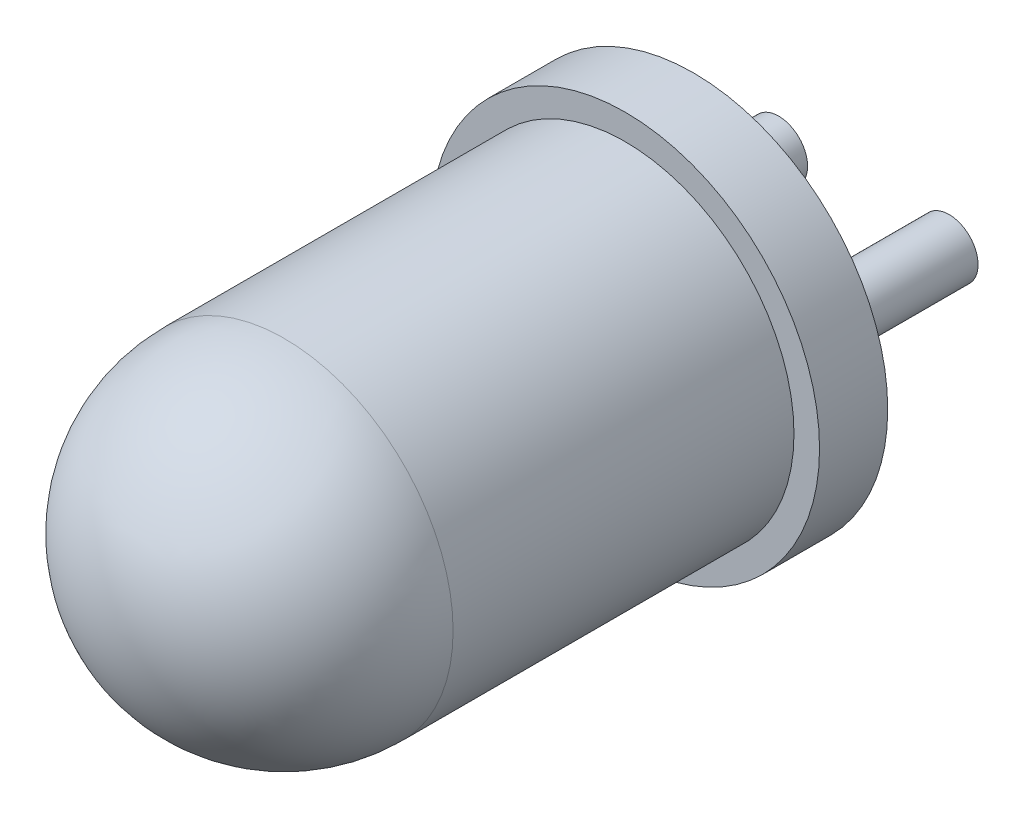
ISO-10303-21;
HEADER;
FILE_DESCRIPTION(('STEP AP214'),'2;1');
FILE_NAME('part.step','',(''),(''),'','','');
FILE_SCHEMA(('AUTOMOTIVE_DESIGN { 1 0 10303 214 1 1 1 1 }'));
ENDSEC;
DATA;
#1=APPLICATION_CONTEXT('core data for automotive mechanical design processes');
#2=APPLICATION_PROTOCOL_DEFINITION('international standard','automotive_design',2000,#1);
#3=PRODUCT_CONTEXT('',#1,'mechanical');
#4=PRODUCT('Part','Part','',(#3));
#5=PRODUCT_RELATED_PRODUCT_CATEGORY('part','',(#4));
#6=PRODUCT_DEFINITION_FORMATION('','',#4);
#7=PRODUCT_DEFINITION_CONTEXT('part definition',#1,'design');
#8=PRODUCT_DEFINITION('design','',#6,#7);
#9=PRODUCT_DEFINITION_SHAPE('','',#8);
#10=(LENGTH_UNIT() NAMED_UNIT(*) SI_UNIT(.MILLI.,.METRE.));
#11=(NAMED_UNIT(*) PLANE_ANGLE_UNIT() SI_UNIT($,.RADIAN.));
#12=(NAMED_UNIT(*) SI_UNIT($,.STERADIAN.) SOLID_ANGLE_UNIT());
#13=UNCERTAINTY_MEASURE_WITH_UNIT(LENGTH_MEASURE(1.E-05),#10,'distance_accuracy_value','');
#14=(GEOMETRIC_REPRESENTATION_CONTEXT(3) GLOBAL_UNCERTAINTY_ASSIGNED_CONTEXT((#13)) GLOBAL_UNIT_ASSIGNED_CONTEXT((#10,
#11,#12)) REPRESENTATION_CONTEXT('',''));
#15=CARTESIAN_POINT('',(0.,0.,0.));
#16=DIRECTION('',(0.,0.,1.));
#17=DIRECTION('',(1.,0.,0.));
#18=AXIS2_PLACEMENT_3D('',#15,#16,#17);
#19=CARTESIAN_POINT('',(1.27,0.,-2.54));
#20=DIRECTION('',(0.,0.,1.));
#21=DIRECTION('',(1.,0.,0.));
#22=AXIS2_PLACEMENT_3D('',#19,#20,#21);
#23=CYLINDRICAL_SURFACE('',#22,0.4318);
#24=CARTESIAN_POINT('',(1.27,0.,-2.54));
#25=DIRECTION('',(0.,0.,-1.));
#26=DIRECTION('',(-1.,0.,0.));
#27=AXIS2_PLACEMENT_3D('',#24,#25,#26);
#28=CIRCLE('',#27,0.4318);
#29=CARTESIAN_POINT('',(0.8382,0.,-2.54));
#30=VERTEX_POINT('',#29);
#31=EDGE_CURVE('E11',#30,#30,#28,.T.);
#32=ORIENTED_EDGE('',*,*,#31,.F.);
#33=EDGE_LOOP('',(#32));
#34=FACE_BOUND('',#33,.T.);
#35=CARTESIAN_POINT('',(1.27,0.,0.));
#36=DIRECTION('',(0.,0.,-1.));
#37=DIRECTION('',(-1.,0.,0.));
#38=AXIS2_PLACEMENT_3D('',#35,#36,#37);
#39=CIRCLE('',#38,0.4318);
#40=CARTESIAN_POINT('',(0.8382,0.,0.));
#41=VERTEX_POINT('',#40);
#42=EDGE_CURVE('E43',#41,#41,#39,.T.);
#43=ORIENTED_EDGE('',*,*,#42,.T.);
#44=EDGE_LOOP('',(#43));
#45=FACE_BOUND('',#44,.T.);
#46=ADVANCED_FACE('F40',(#34,#45),#23,.T.);
#47=CARTESIAN_POINT('',(1.27,0.,-2.54));
#48=DIRECTION('',(0.,0.,-1.));
#49=DIRECTION('',(-1.,0.,0.));
#50=AXIS2_PLACEMENT_3D('',#47,#48,#49);
#51=PLANE('',#50);
#52=ORIENTED_EDGE('',*,*,#31,.T.);
#53=EDGE_LOOP('',(#52));
#54=FACE_BOUND('',#53,.T.);
#55=ADVANCED_FACE('F55',(#54),#51,.T.);
#56=CARTESIAN_POINT('',(1.27,0.,0.));
#57=DIRECTION('',(0.,0.,-1.));
#58=DIRECTION('',(-1.,0.,0.));
#59=AXIS2_PLACEMENT_3D('',#56,#57,#58);
#60=PLANE('',#59);
#61=ORIENTED_EDGE('',*,*,#42,.F.);
#62=EDGE_LOOP('',(#61));
#63=FACE_BOUND('',#62,.T.);
#64=ADVANCED_FACE('F53',(#63),#60,.F.);
#65=CLOSED_SHELL('',(#46,#55,#64));
#66=MANIFOLD_SOLID_BREP('B2',#65);
#67=CARTESIAN_POINT('',(-1.27,0.,-2.54));
#68=DIRECTION('',(0.,0.,1.));
#69=DIRECTION('',(1.,0.,0.));
#70=AXIS2_PLACEMENT_3D('',#67,#68,#69);
#71=CYLINDRICAL_SURFACE('',#70,0.4318);
#72=CARTESIAN_POINT('',(-1.27,0.,-2.54));
#73=DIRECTION('',(0.,0.,-1.));
#74=DIRECTION('',(-1.,0.,0.));
#75=AXIS2_PLACEMENT_3D('',#72,#73,#74);
#76=CIRCLE('',#75,0.4318);
#77=CARTESIAN_POINT('',(-1.7018,0.,-2.54));
#78=VERTEX_POINT('',#77);
#79=EDGE_CURVE('E39',#78,#78,#76,.T.);
#80=ORIENTED_EDGE('',*,*,#79,.F.);
#81=EDGE_LOOP('',(#80));
#82=FACE_BOUND('',#81,.T.);
#83=CARTESIAN_POINT('',(-1.27,0.,0.));
#84=DIRECTION('',(0.,0.,-1.));
#85=DIRECTION('',(-1.,0.,0.));
#86=AXIS2_PLACEMENT_3D('',#83,#84,#85);
#87=CIRCLE('',#86,0.4318);
#88=CARTESIAN_POINT('',(-1.7018,0.,0.));
#89=VERTEX_POINT('',#88);
#90=EDGE_CURVE('E91',#89,#89,#87,.T.);
#91=ORIENTED_EDGE('',*,*,#90,.T.);
#92=EDGE_LOOP('',(#91));
#93=FACE_BOUND('',#92,.T.);
#94=ADVANCED_FACE('F88',(#82,#93),#71,.T.);
#95=CARTESIAN_POINT('',(-1.27,0.,-2.54));
#96=DIRECTION('',(0.,0.,-1.));
#97=DIRECTION('',(-1.,0.,0.));
#98=AXIS2_PLACEMENT_3D('',#95,#96,#97);
#99=PLANE('',#98);
#100=ORIENTED_EDGE('',*,*,#79,.T.);
#101=EDGE_LOOP('',(#100));
#102=FACE_BOUND('',#101,.T.);
#103=ADVANCED_FACE('F103',(#102),#99,.T.);
#104=CARTESIAN_POINT('',(-1.27,0.,0.));
#105=DIRECTION('',(0.,0.,-1.));
#106=DIRECTION('',(-1.,0.,0.));
#107=AXIS2_PLACEMENT_3D('',#104,#105,#106);
#108=PLANE('',#107);
#109=ORIENTED_EDGE('',*,*,#90,.F.);
#110=EDGE_LOOP('',(#109));
#111=FACE_BOUND('',#110,.T.);
#112=ADVANCED_FACE('F101',(#111),#108,.F.);
#113=CLOSED_SHELL('',(#94,#103,#112));
#114=MANIFOLD_SOLID_BREP('B6',#113);
#115=CARTESIAN_POINT('',(0.,0.,1.016));
#116=DIRECTION('',(0.,0.,1.));
#117=DIRECTION('',(1.,0.,0.));
#118=AXIS2_PLACEMENT_3D('',#115,#116,#117);
#119=PLANE('',#118);
#120=CARTESIAN_POINT('',(0.,0.,1.016));
#121=DIRECTION('',(0.,0.,1.));
#122=DIRECTION('',(1.,0.,0.));
#123=AXIS2_PLACEMENT_3D('',#120,#121,#122);
#124=CIRCLE('',#123,2.8956);
#125=CARTESIAN_POINT('',(2.8956,0.,1.016));
#126=VERTEX_POINT('',#125);
#127=EDGE_CURVE('E87',#126,#126,#124,.T.);
#128=ORIENTED_EDGE('',*,*,#127,.T.);
#129=EDGE_LOOP('',(#128));
#130=FACE_BOUND('',#129,.T.);
#131=CARTESIAN_POINT('',(0.,0.,1.016));
#132=DIRECTION('',(0.,0.,1.));
#133=DIRECTION('',(1.,0.,0.));
#134=AXIS2_PLACEMENT_3D('',#131,#132,#133);
#135=CIRCLE('',#134,2.5146);
#136=CARTESIAN_POINT('',(2.5146,0.,1.016));
#137=VERTEX_POINT('',#136);
#138=EDGE_CURVE('E143',#137,#137,#135,.T.);
#139=ORIENTED_EDGE('',*,*,#138,.F.);
#140=EDGE_LOOP('',(#139));
#141=FACE_BOUND('',#140,.T.);
#142=ADVANCED_FACE('F129',(#130,#141),#119,.T.);
#143=CARTESIAN_POINT('',(0.,0.,1.016));
#144=DIRECTION('',(0.,0.,-1.));
#145=DIRECTION('',(-1.,0.,0.));
#146=AXIS2_PLACEMENT_3D('',#143,#144,#145);
#147=CYLINDRICAL_SURFACE('',#146,2.8956);
#148=ORIENTED_EDGE('',*,*,#127,.F.);
#149=EDGE_LOOP('',(#148));
#150=FACE_BOUND('',#149,.T.);
#151=CARTESIAN_POINT('',(0.,0.,0.));
#152=DIRECTION('',(0.,0.,1.));
#153=DIRECTION('',(1.,0.,0.));
#154=AXIS2_PLACEMENT_3D('',#151,#152,#153);
#155=CIRCLE('',#154,2.8956);
#156=CARTESIAN_POINT('',(2.8956,0.,0.));
#157=VERTEX_POINT('',#156);
#158=EDGE_CURVE('E137',#157,#157,#155,.T.);
#159=ORIENTED_EDGE('',*,*,#158,.T.);
#160=EDGE_LOOP('',(#159));
#161=FACE_BOUND('',#160,.T.);
#162=ADVANCED_FACE('F159',(#150,#161),#147,.T.);
#163=CARTESIAN_POINT('',(0.,0.,0.));
#164=DIRECTION('',(0.,0.,1.));
#165=DIRECTION('',(1.,0.,0.));
#166=AXIS2_PLACEMENT_3D('',#163,#164,#165);
#167=PLANE('',#166);
#168=ORIENTED_EDGE('',*,*,#158,.F.);
#169=EDGE_LOOP('',(#168));
#170=FACE_BOUND('',#169,.T.);
#171=ADVANCED_FACE('F153',(#170),#167,.F.);
#172=CARTESIAN_POINT('',(0.,0.,6.096));
#173=DIRECTION('',(0.,0.,-1.));
#174=DIRECTION('',(-1.,0.,0.));
#175=AXIS2_PLACEMENT_3D('',#172,#173,#174);
#176=CYLINDRICAL_SURFACE('',#175,2.5146);
#177=CARTESIAN_POINT('',(0.,0.,6.096));
#178=DIRECTION('',(0.,0.,1.));
#179=DIRECTION('',(1.,0.,0.));
#180=AXIS2_PLACEMENT_3D('',#177,#178,#179);
#181=CIRCLE('',#180,2.5146);
#182=CARTESIAN_POINT('',(2.5146,0.,6.096));
#183=VERTEX_POINT('',#182);
#184=EDGE_CURVE('E133',#183,#183,#181,.T.);
#185=ORIENTED_EDGE('',*,*,#184,.F.);
#186=EDGE_LOOP('',(#185));
#187=FACE_BOUND('',#186,.T.);
#188=ORIENTED_EDGE('',*,*,#138,.T.);
#189=EDGE_LOOP('',(#188));
#190=FACE_BOUND('',#189,.T.);
#191=ADVANCED_FACE('F151',(#187,#190),#176,.T.);
#192=CARTESIAN_POINT('',(0.,0.,6.096));
#193=DIRECTION('',(0.,0.,1.));
#194=DIRECTION('',(1.,0.,0.));
#195=AXIS2_PLACEMENT_3D('',#192,#193,#194);
#196=SPHERICAL_SURFACE('',#195,2.5146);
#197=ORIENTED_EDGE('',*,*,#184,.T.);
#198=EDGE_LOOP('',(#197));
#199=FACE_BOUND('',#198,.T.);
#200=ADVANCED_FACE('F131',(#199),#196,.T.);
#201=CLOSED_SHELL('',(#142,#162,#171,#191,#200));
#202=MANIFOLD_SOLID_BREP('B34',#201);
#203=ADVANCED_BREP_SHAPE_REPRESENTATION('',(#18,#66,#114,#202),#14);
#204=SHAPE_DEFINITION_REPRESENTATION(#9,#203);
ENDSEC;
END-ISO-10303-21;
